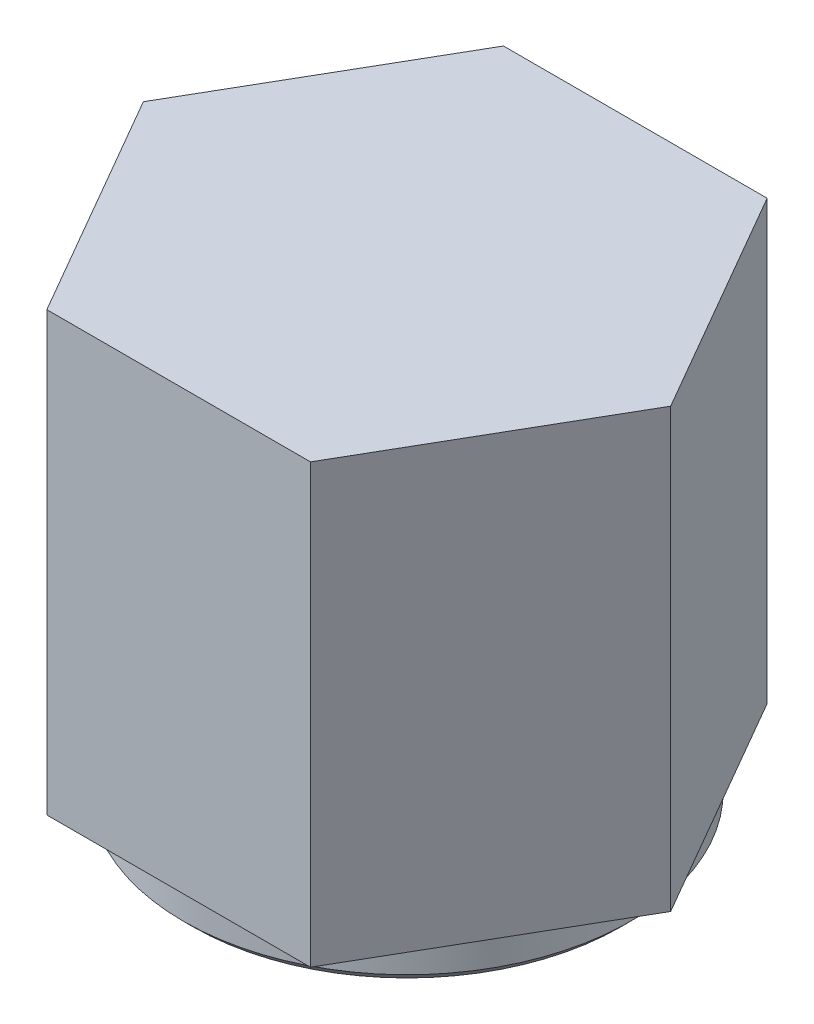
ISO-10303-21;
HEADER;
FILE_DESCRIPTION(('STEP AP214'),'2;1');
FILE_NAME('part.step','',(''),(''),'','','');
FILE_SCHEMA(('AUTOMOTIVE_DESIGN { 1 0 10303 214 1 1 1 1 }'));
ENDSEC;
DATA;
#1=APPLICATION_CONTEXT('core data for automotive mechanical design processes');
#2=APPLICATION_PROTOCOL_DEFINITION('international standard','automotive_design',2000,#1);
#3=PRODUCT_CONTEXT('',#1,'mechanical');
#4=PRODUCT('Part','Part','',(#3));
#5=PRODUCT_RELATED_PRODUCT_CATEGORY('part','',(#4));
#6=PRODUCT_DEFINITION_FORMATION('','',#4);
#7=PRODUCT_DEFINITION_CONTEXT('part definition',#1,'design');
#8=PRODUCT_DEFINITION('design','',#6,#7);
#9=PRODUCT_DEFINITION_SHAPE('','',#8);
#10=(LENGTH_UNIT() NAMED_UNIT(*) SI_UNIT(.MILLI.,.METRE.));
#11=(NAMED_UNIT(*) PLANE_ANGLE_UNIT() SI_UNIT($,.RADIAN.));
#12=(NAMED_UNIT(*) SI_UNIT($,.STERADIAN.) SOLID_ANGLE_UNIT());
#13=UNCERTAINTY_MEASURE_WITH_UNIT(LENGTH_MEASURE(1.E-05),#10,'distance_accuracy_value','');
#14=(GEOMETRIC_REPRESENTATION_CONTEXT(3) GLOBAL_UNCERTAINTY_ASSIGNED_CONTEXT((#13)) GLOBAL_UNIT_ASSIGNED_CONTEXT((#10,
#11,#12)) REPRESENTATION_CONTEXT('',''));
#15=CARTESIAN_POINT('',(0.,0.,0.));
#16=DIRECTION('',(0.,0.,1.));
#17=DIRECTION('',(1.,0.,0.));
#18=AXIS2_PLACEMENT_3D('',#15,#16,#17);
#19=CARTESIAN_POINT('',(13.856406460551,0.,0.));
#20=DIRECTION('',(0.,1.,0.));
#21=DIRECTION('',(0.,0.,1.));
#22=AXIS2_PLACEMENT_3D('',#19,#20,#21);
#23=PLANE('',#22);
#24=CARTESIAN_POINT('',(0.,0.,0.));
#25=DIRECTION('',(0.,1.,0.));
#26=DIRECTION('',(0.,0.,1.));
#27=AXIS2_PLACEMENT_3D('',#24,#25,#26);
#28=CIRCLE('',#27,11.25);
#29=CARTESIAN_POINT('',(0.,0.,11.25));
#30=VERTEX_POINT('',#29);
#31=EDGE_CURVE('E44',#30,#30,#28,.F.);
#32=ORIENTED_EDGE('',*,*,#31,.T.);
#33=EDGE_LOOP('',(#32));
#34=FACE_BOUND('',#33,.T.);
#35=CARTESIAN_POINT('',(0.,0.,0.));
#36=DIRECTION('',(0.,1.,0.));
#37=DIRECTION('',(0.,0.,1.));
#38=AXIS2_PLACEMENT_3D('',#35,#36,#37);
#39=CIRCLE('',#38,10.25);
#40=CARTESIAN_POINT('',(0.,0.,10.25));
#41=VERTEX_POINT('',#40);
#42=EDGE_CURVE('E130',#41,#41,#39,.T.);
#43=ORIENTED_EDGE('',*,*,#42,.T.);
#44=EDGE_LOOP('',(#43));
#45=FACE_BOUND('',#44,.T.);
#46=ADVANCED_FACE('F36',(#34,#45),#23,.F.);
#47=CARTESIAN_POINT('',(0.,18.,0.));
#48=DIRECTION('',(0.,-1.,0.));
#49=DIRECTION('',(0.,0.,-1.));
#50=AXIS2_PLACEMENT_3D('',#47,#48,#49);
#51=CYLINDRICAL_SURFACE('',#50,9.25);
#52=CARTESIAN_POINT('',(0.,13.,0.));
#53=DIRECTION('',(0.,-1.,0.));
#54=DIRECTION('',(0.,0.,-1.));
#55=AXIS2_PLACEMENT_3D('',#52,#53,#54);
#56=CIRCLE('',#55,9.25);
#57=CARTESIAN_POINT('',(0.,13.,-9.25));
#58=VERTEX_POINT('',#57);
#59=EDGE_CURVE('E134',#58,#58,#56,.F.);
#60=ORIENTED_EDGE('',*,*,#59,.T.);
#61=EDGE_LOOP('',(#60));
#62=FACE_BOUND('',#61,.T.);
#63=CARTESIAN_POINT('',(0.,1.,0.));
#64=DIRECTION('',(0.,1.,0.));
#65=DIRECTION('',(0.,0.,1.));
#66=AXIS2_PLACEMENT_3D('',#63,#64,#65);
#67=CIRCLE('',#66,9.25);
#68=CARTESIAN_POINT('',(0.,1.,9.25));
#69=VERTEX_POINT('',#68);
#70=EDGE_CURVE('E127',#69,#69,#67,.F.);
#71=ORIENTED_EDGE('',*,*,#70,.T.);
#72=EDGE_LOOP('',(#71));
#73=FACE_BOUND('',#72,.T.);
#74=ADVANCED_FACE('F164',(#62,#73),#51,.F.);
#75=CARTESIAN_POINT('',(0.,1.,0.));
#76=DIRECTION('',(0.,-1.,0.));
#77=DIRECTION('',(0.,0.,-1.));
#78=AXIS2_PLACEMENT_3D('',#75,#76,#77);
#79=CONICAL_SURFACE('',#78,9.25,0.785398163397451);
#80=ORIENTED_EDGE('',*,*,#42,.F.);
#81=EDGE_LOOP('',(#80));
#82=FACE_BOUND('',#81,.T.);
#83=ORIENTED_EDGE('',*,*,#70,.F.);
#84=EDGE_LOOP('',(#83));
#85=FACE_BOUND('',#84,.T.);
#86=ADVANCED_FACE('F169',(#82,#85),#79,.F.);
#87=CARTESIAN_POINT('',(0.,13.,0.));
#88=DIRECTION('',(0.,1.,0.));
#89=DIRECTION('',(0.,0.,1.));
#90=AXIS2_PLACEMENT_3D('',#87,#88,#89);
#91=CYLINDRICAL_SURFACE('',#90,10.2);
#92=CARTESIAN_POINT('',(0.,14.1571067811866,0.));
#93=DIRECTION('',(0.,-1.,0.));
#94=DIRECTION('',(0.,0.,-1.));
#95=AXIS2_PLACEMENT_3D('',#92,#93,#94);
#96=CIRCLE('',#95,10.2);
#97=CARTESIAN_POINT('',(0.,14.1571067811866,-10.2));
#98=VERTEX_POINT('',#97);
#99=EDGE_CURVE('E141',#98,#98,#96,.T.);
#100=ORIENTED_EDGE('',*,*,#99,.T.);
#101=EDGE_LOOP('',(#100));
#102=FACE_BOUND('',#101,.T.);
#103=CARTESIAN_POINT('',(0.,17.5,0.));
#104=DIRECTION('',(0.,-1.,0.));
#105=DIRECTION('',(0.,0.,-1.));
#106=AXIS2_PLACEMENT_3D('',#103,#104,#105);
#107=CIRCLE('',#106,10.2);
#108=CARTESIAN_POINT('',(0.,17.5,-10.2));
#109=VERTEX_POINT('',#108);
#110=EDGE_CURVE('E133',#109,#109,#107,.F.);
#111=ORIENTED_EDGE('',*,*,#110,.T.);
#112=EDGE_LOOP('',(#111));
#113=FACE_BOUND('',#112,.T.);
#114=ADVANCED_FACE('F192',(#102,#113),#91,.F.);
#115=CARTESIAN_POINT('',(0.,18.,0.));
#116=DIRECTION('',(0.,-1.,0.));
#117=DIRECTION('',(0.,0.,-1.));
#118=AXIS2_PLACEMENT_3D('',#115,#116,#117);
#119=PLANE('',#118);
#120=CARTESIAN_POINT('',(0.,18.,0.));
#121=DIRECTION('',(0.,-1.,0.));
#122=DIRECTION('',(0.,0.,-1.));
#123=AXIS2_PLACEMENT_3D('',#120,#121,#122);
#124=CIRCLE('',#123,3.49999999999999);
#125=CARTESIAN_POINT('',(0.,18.,-3.49999999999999));
#126=VERTEX_POINT('',#125);
#127=EDGE_CURVE('E249',#126,#126,#124,.T.);
#128=ORIENTED_EDGE('',*,*,#127,.F.);
#129=EDGE_LOOP('',(#128));
#130=FACE_BOUND('',#129,.T.);
#131=CARTESIAN_POINT('',(0.,18.,0.));
#132=DIRECTION('',(0.,-1.,0.));
#133=DIRECTION('',(0.,0.,-1.));
#134=AXIS2_PLACEMENT_3D('',#131,#132,#133);
#135=CIRCLE('',#134,9.7);
#136=CARTESIAN_POINT('',(0.,18.,-9.7));
#137=VERTEX_POINT('',#136);
#138=EDGE_CURVE('E98',#137,#137,#135,.T.);
#139=ORIENTED_EDGE('',*,*,#138,.T.);
#140=EDGE_LOOP('',(#139));
#141=FACE_BOUND('',#140,.T.);
#142=ADVANCED_FACE('F198',(#130,#141),#119,.T.);
#143=CARTESIAN_POINT('',(0.,13.95,0.));
#144=DIRECTION('',(0.,1.,0.));
#145=DIRECTION('',(0.,0.,1.));
#146=AXIS2_PLACEMENT_3D('',#143,#144,#145);
#147=CONICAL_SURFACE('',#146,10.2,0.785398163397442);
#148=CARTESIAN_POINT('',(0.,13.8035533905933,0.));
#149=DIRECTION('',(0.,-1.,0.));
#150=DIRECTION('',(0.,0.,-1.));
#151=AXIS2_PLACEMENT_3D('',#148,#149,#150);
#152=CIRCLE('',#151,10.0535533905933);
#153=CARTESIAN_POINT('',(0.,13.8035533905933,-10.0535533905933));
#154=VERTEX_POINT('',#153);
#155=EDGE_CURVE('E144',#154,#154,#152,.F.);
#156=ORIENTED_EDGE('',*,*,#155,.T.);
#157=EDGE_LOOP('',(#156));
#158=FACE_BOUND('',#157,.T.);
#159=ORIENTED_EDGE('',*,*,#59,.F.);
#160=EDGE_LOOP('',(#159));
#161=FACE_BOUND('',#160,.T.);
#162=ADVANCED_FACE('F194',(#158,#161),#147,.F.);
#163=CARTESIAN_POINT('',(0.,14.1571067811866,0.));
#164=DIRECTION('',(0.,-1.,0.));
#165=DIRECTION('',(0.,0.,-1.));
#166=AXIS2_PLACEMENT_3D('',#163,#164,#165);
#167=TOROIDAL_SURFACE('',#166,9.7,0.5);
#168=ORIENTED_EDGE('',*,*,#155,.F.);
#169=EDGE_LOOP('',(#168));
#170=FACE_BOUND('',#169,.T.);
#171=ORIENTED_EDGE('',*,*,#99,.F.);
#172=EDGE_LOOP('',(#171));
#173=FACE_BOUND('',#172,.T.);
#174=ADVANCED_FACE('F197',(#170,#173),#167,.F.);
#175=CARTESIAN_POINT('',(0.,17.5,0.));
#176=DIRECTION('',(0.,-1.,0.));
#177=DIRECTION('',(0.,0.,-1.));
#178=AXIS2_PLACEMENT_3D('',#175,#176,#177);
#179=TOROIDAL_SURFACE('',#178,9.7,0.5);
#180=ORIENTED_EDGE('',*,*,#110,.F.);
#181=EDGE_LOOP('',(#180));
#182=FACE_BOUND('',#181,.T.);
#183=ORIENTED_EDGE('',*,*,#138,.F.);
#184=EDGE_LOOP('',(#183));
#185=FACE_BOUND('',#184,.T.);
#186=ADVANCED_FACE('F201',(#182,#185),#179,.F.);
#187=CARTESIAN_POINT('',(0.,22.,0.));
#188=DIRECTION('',(0.,-1.,0.));
#189=DIRECTION('',(0.,0.,-1.));
#190=AXIS2_PLACEMENT_3D('',#187,#188,#189);
#191=CONICAL_SURFACE('',#190,3.5,1.0471975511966);
#192=CARTESIAN_POINT('',(0.,24.0207259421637,0.));
#193=VERTEX_POINT('',#192);
#194=VERTEX_LOOP('',#193);
#195=FACE_BOUND('',#194,.T.);
#196=CARTESIAN_POINT('',(0.,22.,0.));
#197=DIRECTION('',(0.,-1.,0.));
#198=DIRECTION('',(0.,0.,-1.));
#199=AXIS2_PLACEMENT_3D('',#196,#197,#198);
#200=CIRCLE('',#199,3.5);
#201=CARTESIAN_POINT('',(0.,22.,-3.5));
#202=VERTEX_POINT('',#201);
#203=EDGE_CURVE('E138',#202,#202,#200,.T.);
#204=ORIENTED_EDGE('',*,*,#203,.T.);
#205=EDGE_LOOP('',(#204));
#206=FACE_BOUND('',#205,.T.);
#207=ADVANCED_FACE('F204',(#195,#206),#191,.F.);
#208=CARTESIAN_POINT('',(0.,18.,0.));
#209=DIRECTION('',(0.,-1.,0.));
#210=DIRECTION('',(0.,0.,-1.));
#211=AXIS2_PLACEMENT_3D('',#208,#209,#210);
#212=CYLINDRICAL_SURFACE('',#211,3.49999999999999);
#213=ORIENTED_EDGE('',*,*,#203,.F.);
#214=EDGE_LOOP('',(#213));
#215=FACE_BOUND('',#214,.T.);
#216=ORIENTED_EDGE('',*,*,#127,.T.);
#217=EDGE_LOOP('',(#216));
#218=FACE_BOUND('',#217,.T.);
#219=ADVANCED_FACE('F209',(#215,#218),#212,.F.);
#220=CARTESIAN_POINT('',(0.,2.,0.));
#221=DIRECTION('',(0.,-1.,0.));
#222=DIRECTION('',(0.,0.,-1.));
#223=AXIS2_PLACEMENT_3D('',#220,#221,#222);
#224=PLANE('',#223);
#225=CARTESIAN_POINT('',(0.,2.,0.));
#226=DIRECTION('',(0.,-1.,0.));
#227=DIRECTION('',(0.,0.,-1.));
#228=AXIS2_PLACEMENT_3D('',#225,#226,#227);
#229=CIRCLE('',#228,11.75);
#230=CARTESIAN_POINT('',(0.,2.,-11.75));
#231=VERTEX_POINT('',#230);
#232=EDGE_CURVE('E109',#231,#231,#229,.T.);
#233=ORIENTED_EDGE('',*,*,#232,.F.);
#234=EDGE_LOOP('',(#233));
#235=FACE_BOUND('',#234,.T.);
#236=DIRECTION('',(-0.5,0.,0.866025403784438));
#237=VECTOR('',#236,1.);
#238=CARTESIAN_POINT('',(6.9282032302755,2.,12.));
#239=LINE('',#238,#237);
#240=CARTESIAN_POINT('',(13.856406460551,2.,0.));
#241=VERTEX_POINT('',#240);
#242=CARTESIAN_POINT('',(6.9282032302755,2.,12.));
#243=VERTEX_POINT('',#242);
#244=EDGE_CURVE('E51',#241,#243,#239,.T.);
#245=ORIENTED_EDGE('',*,*,#244,.T.);
#246=DIRECTION('',(-1.,0.,0.));
#247=VECTOR('',#246,1.);
#248=CARTESIAN_POINT('',(-6.92820323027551,2.,12.));
#249=LINE('',#248,#247);
#250=CARTESIAN_POINT('',(-6.92820323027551,2.,12.));
#251=VERTEX_POINT('',#250);
#252=EDGE_CURVE('E90',#243,#251,#249,.T.);
#253=ORIENTED_EDGE('',*,*,#252,.T.);
#254=DIRECTION('',(-0.5,0.,-0.866025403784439));
#255=VECTOR('',#254,1.);
#256=CARTESIAN_POINT('',(-13.856406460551,2.,0.));
#257=LINE('',#256,#255);
#258=CARTESIAN_POINT('',(-13.856406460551,2.,0.));
#259=VERTEX_POINT('',#258);
#260=EDGE_CURVE('E93',#251,#259,#257,.T.);
#261=ORIENTED_EDGE('',*,*,#260,.T.);
#262=DIRECTION('',(0.5,0.,-0.866025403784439));
#263=VECTOR('',#262,1.);
#264=CARTESIAN_POINT('',(-6.92820323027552,2.,-12.));
#265=LINE('',#264,#263);
#266=CARTESIAN_POINT('',(-6.92820323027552,2.,-12.));
#267=VERTEX_POINT('',#266);
#268=EDGE_CURVE('E108',#259,#267,#265,.T.);
#269=ORIENTED_EDGE('',*,*,#268,.T.);
#270=DIRECTION('',(1.,0.,0.));
#271=VECTOR('',#270,1.);
#272=CARTESIAN_POINT('',(6.92820323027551,2.,-12.));
#273=LINE('',#272,#271);
#274=CARTESIAN_POINT('',(6.92820323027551,2.,-12.));
#275=VERTEX_POINT('',#274);
#276=EDGE_CURVE('E244',#267,#275,#273,.T.);
#277=ORIENTED_EDGE('',*,*,#276,.T.);
#278=DIRECTION('',(0.5,0.,0.866025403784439));
#279=VECTOR('',#278,1.);
#280=CARTESIAN_POINT('',(13.856406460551,2.,0.));
#281=LINE('',#280,#279);
#282=EDGE_CURVE('E246',#275,#241,#281,.T.);
#283=ORIENTED_EDGE('',*,*,#282,.T.);
#284=EDGE_LOOP('',(#245,#253,#261,#269,#277,#283));
#285=FACE_BOUND('',#284,.T.);
#286=ADVANCED_FACE('F92',(#235,#285),#224,.T.);
#287=CARTESIAN_POINT('',(0.,2.,0.));
#288=DIRECTION('',(0.,-1.,0.));
#289=DIRECTION('',(0.,0.,-1.));
#290=AXIS2_PLACEMENT_3D('',#287,#288,#289);
#291=CYLINDRICAL_SURFACE('',#290,11.75);
#292=CARTESIAN_POINT('',(0.,0.500000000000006,0.));
#293=DIRECTION('',(0.,1.,0.));
#294=DIRECTION('',(0.,0.,1.));
#295=AXIS2_PLACEMENT_3D('',#292,#293,#294);
#296=CIRCLE('',#295,11.75);
#297=CARTESIAN_POINT('',(0.,0.500000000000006,11.75));
#298=VERTEX_POINT('',#297);
#299=EDGE_CURVE('E12',#298,#298,#296,.T.);
#300=ORIENTED_EDGE('',*,*,#299,.T.);
#301=EDGE_LOOP('',(#300));
#302=FACE_BOUND('',#301,.T.);
#303=ORIENTED_EDGE('',*,*,#232,.T.);
#304=EDGE_LOOP('',(#303));
#305=FACE_BOUND('',#304,.T.);
#306=ADVANCED_FACE('F231',(#302,#305),#291,.T.);
#307=CARTESIAN_POINT('',(13.856406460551,25.,0.));
#308=DIRECTION('',(0.,1.,0.));
#309=DIRECTION('',(0.,0.,1.));
#310=AXIS2_PLACEMENT_3D('',#307,#308,#309);
#311=PLANE('',#310);
#312=DIRECTION('',(0.5,0.,-0.866025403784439));
#313=VECTOR('',#312,1.);
#314=CARTESIAN_POINT('',(6.9282032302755,25.,12.));
#315=LINE('',#314,#313);
#316=CARTESIAN_POINT('',(6.9282032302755,25.,12.));
#317=VERTEX_POINT('',#316);
#318=CARTESIAN_POINT('',(13.856406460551,25.,0.));
#319=VERTEX_POINT('',#318);
#320=EDGE_CURVE('E137',#317,#319,#315,.T.);
#321=ORIENTED_EDGE('',*,*,#320,.T.);
#322=DIRECTION('',(-0.5,0.,-0.866025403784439));
#323=VECTOR('',#322,1.);
#324=CARTESIAN_POINT('',(13.856406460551,25.,0.));
#325=LINE('',#324,#323);
#326=CARTESIAN_POINT('',(6.92820323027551,25.,-12.));
#327=VERTEX_POINT('',#326);
#328=EDGE_CURVE('E255',#319,#327,#325,.T.);
#329=ORIENTED_EDGE('',*,*,#328,.T.);
#330=DIRECTION('',(-1.,0.,0.));
#331=VECTOR('',#330,1.);
#332=CARTESIAN_POINT('',(6.92820323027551,25.,-12.));
#333=LINE('',#332,#331);
#334=CARTESIAN_POINT('',(-6.92820323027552,25.,-12.));
#335=VERTEX_POINT('',#334);
#336=EDGE_CURVE('E257',#327,#335,#333,.T.);
#337=ORIENTED_EDGE('',*,*,#336,.T.);
#338=DIRECTION('',(-0.5,0.,0.866025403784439));
#339=VECTOR('',#338,1.);
#340=CARTESIAN_POINT('',(-6.92820323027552,25.,-12.));
#341=LINE('',#340,#339);
#342=CARTESIAN_POINT('',(-13.856406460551,25.,0.));
#343=VERTEX_POINT('',#342);
#344=EDGE_CURVE('E259',#335,#343,#341,.T.);
#345=ORIENTED_EDGE('',*,*,#344,.T.);
#346=DIRECTION('',(0.5,0.,0.866025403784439));
#347=VECTOR('',#346,1.);
#348=CARTESIAN_POINT('',(-13.856406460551,25.,0.));
#349=LINE('',#348,#347);
#350=CARTESIAN_POINT('',(-6.92820323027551,25.,12.));
#351=VERTEX_POINT('',#350);
#352=EDGE_CURVE('E261',#343,#351,#349,.T.);
#353=ORIENTED_EDGE('',*,*,#352,.T.);
#354=DIRECTION('',(1.,0.,0.));
#355=VECTOR('',#354,1.);
#356=CARTESIAN_POINT('',(-6.92820323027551,25.,12.));
#357=LINE('',#356,#355);
#358=EDGE_CURVE('E59',#351,#317,#357,.T.);
#359=ORIENTED_EDGE('',*,*,#358,.T.);
#360=EDGE_LOOP('',(#321,#329,#337,#345,#353,#359));
#361=FACE_BOUND('',#360,.T.);
#362=ADVANCED_FACE('F174',(#361),#311,.T.);
#363=CARTESIAN_POINT('',(-6.92820323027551,25.,12.));
#364=DIRECTION('',(0.,0.,-1.));
#365=DIRECTION('',(-1.,0.,0.));
#366=AXIS2_PLACEMENT_3D('',#363,#364,#365);
#367=PLANE('',#366);
#368=ORIENTED_EDGE('',*,*,#252,.F.);
#369=DIRECTION('',(0.,-1.,0.));
#370=VECTOR('',#369,1.);
#371=CARTESIAN_POINT('',(6.9282032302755,25.,12.));
#372=LINE('',#371,#370);
#373=EDGE_CURVE('E112',#317,#243,#372,.T.);
#374=ORIENTED_EDGE('',*,*,#373,.F.);
#375=ORIENTED_EDGE('',*,*,#358,.F.);
#376=DIRECTION('',(0.,-1.,0.));
#377=VECTOR('',#376,1.);
#378=CARTESIAN_POINT('',(-6.92820323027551,25.,12.));
#379=LINE('',#378,#377);
#380=EDGE_CURVE('E105',#351,#251,#379,.T.);
#381=ORIENTED_EDGE('',*,*,#380,.T.);
#382=EDGE_LOOP('',(#368,#374,#375,#381));
#383=FACE_BOUND('',#382,.T.);
#384=ADVANCED_FACE('F111',(#383),#367,.F.);
#385=CARTESIAN_POINT('',(-13.856406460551,25.,0.));
#386=DIRECTION('',(0.866025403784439,0.,-0.5));
#387=DIRECTION('',(-0.5,0.,-0.866025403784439));
#388=AXIS2_PLACEMENT_3D('',#385,#386,#387);
#389=PLANE('',#388);
#390=ORIENTED_EDGE('',*,*,#260,.F.);
#391=ORIENTED_EDGE('',*,*,#380,.F.);
#392=ORIENTED_EDGE('',*,*,#352,.F.);
#393=DIRECTION('',(0.,-1.,0.));
#394=VECTOR('',#393,1.);
#395=CARTESIAN_POINT('',(-13.856406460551,25.,0.));
#396=LINE('',#395,#394);
#397=EDGE_CURVE('E107',#343,#259,#396,.T.);
#398=ORIENTED_EDGE('',*,*,#397,.T.);
#399=EDGE_LOOP('',(#390,#391,#392,#398));
#400=FACE_BOUND('',#399,.T.);
#401=ADVANCED_FACE('F103',(#400),#389,.F.);
#402=CARTESIAN_POINT('',(-6.92820323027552,25.,-12.));
#403=DIRECTION('',(0.866025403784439,0.,0.5));
#404=DIRECTION('',(0.5,0.,-0.866025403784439));
#405=AXIS2_PLACEMENT_3D('',#402,#403,#404);
#406=PLANE('',#405);
#407=ORIENTED_EDGE('',*,*,#268,.F.);
#408=ORIENTED_EDGE('',*,*,#397,.F.);
#409=ORIENTED_EDGE('',*,*,#344,.F.);
#410=DIRECTION('',(0.,-1.,0.));
#411=VECTOR('',#410,1.);
#412=CARTESIAN_POINT('',(-6.92820323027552,25.,-12.));
#413=LINE('',#412,#411);
#414=EDGE_CURVE('E114',#335,#267,#413,.T.);
#415=ORIENTED_EDGE('',*,*,#414,.T.);
#416=EDGE_LOOP('',(#407,#408,#409,#415));
#417=FACE_BOUND('',#416,.T.);
#418=ADVANCED_FACE('F179',(#417),#406,.F.);
#419=CARTESIAN_POINT('',(6.92820323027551,25.,-12.));
#420=DIRECTION('',(0.,0.,1.));
#421=DIRECTION('',(1.,0.,0.));
#422=AXIS2_PLACEMENT_3D('',#419,#420,#421);
#423=PLANE('',#422);
#424=ORIENTED_EDGE('',*,*,#276,.F.);
#425=ORIENTED_EDGE('',*,*,#414,.F.);
#426=ORIENTED_EDGE('',*,*,#336,.F.);
#427=DIRECTION('',(0.,-1.,0.));
#428=VECTOR('',#427,1.);
#429=CARTESIAN_POINT('',(6.92820323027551,25.,-12.));
#430=LINE('',#429,#428);
#431=EDGE_CURVE('E121',#327,#275,#430,.T.);
#432=ORIENTED_EDGE('',*,*,#431,.T.);
#433=EDGE_LOOP('',(#424,#425,#426,#432));
#434=FACE_BOUND('',#433,.T.);
#435=ADVANCED_FACE('F182',(#434),#423,.F.);
#436=CARTESIAN_POINT('',(13.856406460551,25.,0.));
#437=DIRECTION('',(-0.866025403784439,0.,0.5));
#438=DIRECTION('',(0.5,0.,0.866025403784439));
#439=AXIS2_PLACEMENT_3D('',#436,#437,#438);
#440=PLANE('',#439);
#441=ORIENTED_EDGE('',*,*,#282,.F.);
#442=ORIENTED_EDGE('',*,*,#431,.F.);
#443=ORIENTED_EDGE('',*,*,#328,.F.);
#444=DIRECTION('',(0.,-1.,0.));
#445=VECTOR('',#444,1.);
#446=CARTESIAN_POINT('',(13.856406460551,25.,0.));
#447=LINE('',#446,#445);
#448=EDGE_CURVE('E124',#319,#241,#447,.T.);
#449=ORIENTED_EDGE('',*,*,#448,.T.);
#450=EDGE_LOOP('',(#441,#442,#443,#449));
#451=FACE_BOUND('',#450,.T.);
#452=ADVANCED_FACE('F159',(#451),#440,.F.);
#453=CARTESIAN_POINT('',(6.9282032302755,25.,12.));
#454=DIRECTION('',(-0.866025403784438,0.,-0.5));
#455=DIRECTION('',(-0.5,0.,0.866025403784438));
#456=AXIS2_PLACEMENT_3D('',#453,#454,#455);
#457=PLANE('',#456);
#458=ORIENTED_EDGE('',*,*,#244,.F.);
#459=ORIENTED_EDGE('',*,*,#448,.F.);
#460=ORIENTED_EDGE('',*,*,#320,.F.);
#461=ORIENTED_EDGE('',*,*,#373,.T.);
#462=EDGE_LOOP('',(#458,#459,#460,#461));
#463=FACE_BOUND('',#462,.T.);
#464=ADVANCED_FACE('F154',(#463),#457,.F.);
#465=CARTESIAN_POINT('',(0.,0.,0.));
#466=DIRECTION('',(0.,1.,0.));
#467=DIRECTION('',(0.,0.,1.));
#468=AXIS2_PLACEMENT_3D('',#465,#466,#467);
#469=CONICAL_SURFACE('',#468,11.25,0.785398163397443);
#470=ORIENTED_EDGE('',*,*,#299,.F.);
#471=EDGE_LOOP('',(#470));
#472=FACE_BOUND('',#471,.T.);
#473=ORIENTED_EDGE('',*,*,#31,.F.);
#474=EDGE_LOOP('',(#473));
#475=FACE_BOUND('',#474,.T.);
#476=ADVANCED_FACE('F38',(#472,#475),#469,.T.);
#477=CLOSED_SHELL('',(#46,#74,#86,#114,#142,#162,#174,#186,#207,#219,#286,#306,#362,#384,#401,
#418,#435,#452,#464,#476));
#478=MANIFOLD_SOLID_BREP('B2',#477);
#479=ADVANCED_BREP_SHAPE_REPRESENTATION('',(#18,#478),#14);
#480=SHAPE_DEFINITION_REPRESENTATION(#9,#479);
ENDSEC;
END-ISO-10303-21;
